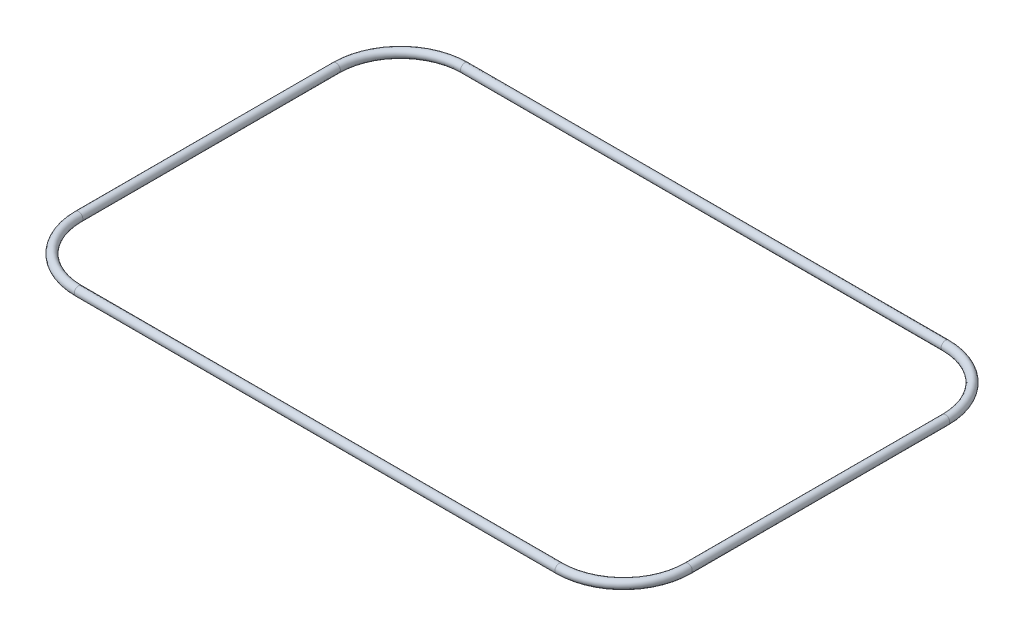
ISO-10303-21;
HEADER;
FILE_DESCRIPTION(('STEP AP214'),'2;1');
FILE_NAME('part.step','',(''),(''),'','','');
FILE_SCHEMA(('AUTOMOTIVE_DESIGN { 1 0 10303 214 1 1 1 1 }'));
ENDSEC;
DATA;
#1=APPLICATION_CONTEXT('core data for automotive mechanical design processes');
#2=APPLICATION_PROTOCOL_DEFINITION('international standard','automotive_design',2000,#1);
#3=PRODUCT_CONTEXT('',#1,'mechanical');
#4=PRODUCT('Part','Part','',(#3));
#5=PRODUCT_RELATED_PRODUCT_CATEGORY('part','',(#4));
#6=PRODUCT_DEFINITION_FORMATION('','',#4);
#7=PRODUCT_DEFINITION_CONTEXT('part definition',#1,'design');
#8=PRODUCT_DEFINITION('design','',#6,#7);
#9=PRODUCT_DEFINITION_SHAPE('','',#8);
#10=(LENGTH_UNIT() NAMED_UNIT(*) SI_UNIT(.MILLI.,.METRE.));
#11=(NAMED_UNIT(*) PLANE_ANGLE_UNIT() SI_UNIT($,.RADIAN.));
#12=(NAMED_UNIT(*) SI_UNIT($,.STERADIAN.) SOLID_ANGLE_UNIT());
#13=UNCERTAINTY_MEASURE_WITH_UNIT(LENGTH_MEASURE(1.E-05),#10,'distance_accuracy_value','');
#14=(GEOMETRIC_REPRESENTATION_CONTEXT(3) GLOBAL_UNCERTAINTY_ASSIGNED_CONTEXT((#13)) GLOBAL_UNIT_ASSIGNED_CONTEXT((#10,
#11,#12)) REPRESENTATION_CONTEXT('',''));
#15=CARTESIAN_POINT('',(0.,0.,0.));
#16=DIRECTION('',(0.,0.,1.));
#17=DIRECTION('',(1.,0.,0.));
#18=AXIS2_PLACEMENT_3D('',#15,#16,#17);
#19=CARTESIAN_POINT('',(56.355,0.,23.81375));
#20=DIRECTION('',(0.,0.,-1.));
#21=DIRECTION('',(-1.,0.,0.));
#22=AXIS2_PLACEMENT_3D('',#19,#20,#21);
#23=CYLINDRICAL_SURFACE('',#22,0.793750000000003);
#24=CARTESIAN_POINT('',(56.355,0.,-23.81375));
#25=DIRECTION('',(0.,0.,-1.));
#26=DIRECTION('',(-1.,0.,0.));
#27=AXIS2_PLACEMENT_3D('',#24,#25,#26);
#28=CIRCLE('',#27,0.793750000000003);
#29=CARTESIAN_POINT('',(57.14875,0.,-23.81375));
#30=VERTEX_POINT('',#29);
#31=EDGE_CURVE('E81',#30,#30,#28,.T.);
#32=ORIENTED_EDGE('',*,*,#31,.F.);
#33=EDGE_LOOP('',(#32));
#34=FACE_BOUND('',#33,.T.);
#35=CARTESIAN_POINT('',(56.355,0.,23.81375));
#36=DIRECTION('',(0.,0.,-1.));
#37=DIRECTION('',(-1.,0.,0.));
#38=AXIS2_PLACEMENT_3D('',#35,#36,#37);
#39=CIRCLE('',#38,0.793750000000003);
#40=CARTESIAN_POINT('',(57.14875,0.,23.81375));
#41=VERTEX_POINT('',#40);
#42=EDGE_CURVE('E11',#41,#41,#39,.T.);
#43=ORIENTED_EDGE('',*,*,#42,.T.);
#44=EDGE_LOOP('',(#43));
#45=FACE_BOUND('',#44,.T.);
#46=ADVANCED_FACE('F44',(#34,#45),#23,.T.);
#47=CARTESIAN_POINT('',(44.44875,0.,23.81375));
#48=DIRECTION('',(0.,1.,0.));
#49=DIRECTION('',(0.,0.,1.));
#50=AXIS2_PLACEMENT_3D('',#47,#48,#49);
#51=TOROIDAL_SURFACE('',#50,11.90625,0.793750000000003);
#52=CARTESIAN_POINT('',(44.44875,0.,35.72));
#53=DIRECTION('',(1.,0.,0.));
#54=DIRECTION('',(0.,0.,-1.));
#55=AXIS2_PLACEMENT_3D('',#52,#53,#54);
#56=CIRCLE('',#55,0.793750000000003);
#57=CARTESIAN_POINT('',(44.44875,0.,36.51375));
#58=VERTEX_POINT('',#57);
#59=EDGE_CURVE('E51',#58,#58,#56,.T.);
#60=CARTESIAN_POINT('',(44.44875,0.,23.81375));
#61=DIRECTION('',(0.,1.,0.));
#62=DIRECTION('',(0.,0.,1.));
#63=AXIS2_PLACEMENT_3D('',#60,#61,#62);
#64=CIRCLE('',#63,12.7);
#65=EDGE_CURVE('',#58,#41,#64,.T.);
#66=ORIENTED_EDGE('',*,*,#59,.T.);
#67=ORIENTED_EDGE('',*,*,#42,.F.);
#68=ORIENTED_EDGE('',*,*,#65,.T.);
#69=ORIENTED_EDGE('',*,*,#65,.F.);
#70=EDGE_LOOP('',(#66,#68,#67,#69));
#71=FACE_BOUND('',#70,.T.);
#72=ADVANCED_FACE('F90',(#71),#51,.T.);
#73=CARTESIAN_POINT('',(-44.44875,0.,35.72));
#74=DIRECTION('',(1.,0.,0.));
#75=DIRECTION('',(0.,0.,-1.));
#76=AXIS2_PLACEMENT_3D('',#73,#74,#75);
#77=CYLINDRICAL_SURFACE('',#76,0.793750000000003);
#78=ORIENTED_EDGE('',*,*,#59,.F.);
#79=EDGE_LOOP('',(#78));
#80=FACE_BOUND('',#79,.T.);
#81=CARTESIAN_POINT('',(-44.44875,0.,35.72));
#82=DIRECTION('',(1.,0.,0.));
#83=DIRECTION('',(0.,0.,-1.));
#84=AXIS2_PLACEMENT_3D('',#81,#82,#83);
#85=CIRCLE('',#84,0.793750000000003);
#86=CARTESIAN_POINT('',(-44.44875,0.,36.51375));
#87=VERTEX_POINT('',#86);
#88=EDGE_CURVE('E57',#87,#87,#85,.T.);
#89=ORIENTED_EDGE('',*,*,#88,.T.);
#90=EDGE_LOOP('',(#89));
#91=FACE_BOUND('',#90,.T.);
#92=ADVANCED_FACE('F94',(#80,#91),#77,.T.);
#93=CARTESIAN_POINT('',(-44.44875,0.,23.81375));
#94=DIRECTION('',(0.,1.,0.));
#95=DIRECTION('',(0.,0.,1.));
#96=AXIS2_PLACEMENT_3D('',#93,#94,#95);
#97=TOROIDAL_SURFACE('',#96,11.90625,0.793750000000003);
#98=CARTESIAN_POINT('',(-56.355,0.,23.81375));
#99=DIRECTION('',(0.,0.,1.));
#100=DIRECTION('',(1.,0.,0.));
#101=AXIS2_PLACEMENT_3D('',#98,#99,#100);
#102=CIRCLE('',#101,0.793750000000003);
#103=CARTESIAN_POINT('',(-57.14875,0.,23.81375));
#104=VERTEX_POINT('',#103);
#105=EDGE_CURVE('E63',#104,#104,#102,.T.);
#106=CARTESIAN_POINT('',(-44.44875,0.,23.81375));
#107=DIRECTION('',(0.,1.,0.));
#108=DIRECTION('',(0.,0.,1.));
#109=AXIS2_PLACEMENT_3D('',#106,#107,#108);
#110=CIRCLE('',#109,12.7);
#111=EDGE_CURVE('',#104,#87,#110,.T.);
#112=ORIENTED_EDGE('',*,*,#105,.T.);
#113=ORIENTED_EDGE('',*,*,#88,.F.);
#114=ORIENTED_EDGE('',*,*,#111,.T.);
#115=ORIENTED_EDGE('',*,*,#111,.F.);
#116=EDGE_LOOP('',(#112,#114,#113,#115));
#117=FACE_BOUND('',#116,.T.);
#118=ADVANCED_FACE('F99',(#117),#97,.T.);
#119=CARTESIAN_POINT('',(-56.355,0.,-23.81375));
#120=DIRECTION('',(0.,0.,1.));
#121=DIRECTION('',(1.,0.,0.));
#122=AXIS2_PLACEMENT_3D('',#119,#120,#121);
#123=CYLINDRICAL_SURFACE('',#122,0.793750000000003);
#124=ORIENTED_EDGE('',*,*,#105,.F.);
#125=EDGE_LOOP('',(#124));
#126=FACE_BOUND('',#125,.T.);
#127=CARTESIAN_POINT('',(-56.355,0.,-23.81375));
#128=DIRECTION('',(0.,0.,1.));
#129=DIRECTION('',(1.,0.,0.));
#130=AXIS2_PLACEMENT_3D('',#127,#128,#129);
#131=CIRCLE('',#130,0.793750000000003);
#132=CARTESIAN_POINT('',(-57.14875,0.,-23.81375));
#133=VERTEX_POINT('',#132);
#134=EDGE_CURVE('E69',#133,#133,#131,.T.);
#135=ORIENTED_EDGE('',*,*,#134,.T.);
#136=EDGE_LOOP('',(#135));
#137=FACE_BOUND('',#136,.T.);
#138=ADVANCED_FACE('F105',(#126,#137),#123,.T.);
#139=CARTESIAN_POINT('',(-44.44875,0.,-23.81375));
#140=DIRECTION('',(0.,1.,0.));
#141=DIRECTION('',(0.,0.,1.));
#142=AXIS2_PLACEMENT_3D('',#139,#140,#141);
#143=TOROIDAL_SURFACE('',#142,11.90625,0.793750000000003);
#144=CARTESIAN_POINT('',(-44.44875,0.,-35.72));
#145=DIRECTION('',(-1.,0.,0.));
#146=DIRECTION('',(0.,0.,1.));
#147=AXIS2_PLACEMENT_3D('',#144,#145,#146);
#148=CIRCLE('',#147,0.793750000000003);
#149=CARTESIAN_POINT('',(-44.44875,0.,-36.51375));
#150=VERTEX_POINT('',#149);
#151=EDGE_CURVE('E73',#150,#150,#148,.T.);
#152=CARTESIAN_POINT('',(-44.44875,0.,-23.81375));
#153=DIRECTION('',(0.,1.,0.));
#154=DIRECTION('',(0.,0.,1.));
#155=AXIS2_PLACEMENT_3D('',#152,#153,#154);
#156=CIRCLE('',#155,12.7);
#157=EDGE_CURVE('',#150,#133,#156,.T.);
#158=ORIENTED_EDGE('',*,*,#151,.T.);
#159=ORIENTED_EDGE('',*,*,#134,.F.);
#160=ORIENTED_EDGE('',*,*,#157,.T.);
#161=ORIENTED_EDGE('',*,*,#157,.F.);
#162=EDGE_LOOP('',(#158,#160,#159,#161));
#163=FACE_BOUND('',#162,.T.);
#164=ADVANCED_FACE('F109',(#163),#143,.T.);
#165=CARTESIAN_POINT('',(44.44875,0.,-35.72));
#166=DIRECTION('',(-1.,0.,0.));
#167=DIRECTION('',(0.,0.,1.));
#168=AXIS2_PLACEMENT_3D('',#165,#166,#167);
#169=CYLINDRICAL_SURFACE('',#168,0.793750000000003);
#170=ORIENTED_EDGE('',*,*,#151,.F.);
#171=EDGE_LOOP('',(#170));
#172=FACE_BOUND('',#171,.T.);
#173=CARTESIAN_POINT('',(44.44875,0.,-35.72));
#174=DIRECTION('',(-1.,0.,0.));
#175=DIRECTION('',(0.,0.,1.));
#176=AXIS2_PLACEMENT_3D('',#173,#174,#175);
#177=CIRCLE('',#176,0.793750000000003);
#178=CARTESIAN_POINT('',(44.44875,0.,-36.51375));
#179=VERTEX_POINT('',#178);
#180=EDGE_CURVE('E77',#179,#179,#177,.T.);
#181=ORIENTED_EDGE('',*,*,#180,.T.);
#182=EDGE_LOOP('',(#181));
#183=FACE_BOUND('',#182,.T.);
#184=ADVANCED_FACE('F113',(#172,#183),#169,.T.);
#185=CARTESIAN_POINT('',(44.44875,0.,-23.81375));
#186=DIRECTION('',(0.,1.,0.));
#187=DIRECTION('',(0.,0.,1.));
#188=AXIS2_PLACEMENT_3D('',#185,#186,#187);
#189=TOROIDAL_SURFACE('',#188,11.90625,0.793750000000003);
#190=CARTESIAN_POINT('',(44.44875,0.,-23.81375));
#191=DIRECTION('',(0.,1.,0.));
#192=DIRECTION('',(0.,0.,1.));
#193=AXIS2_PLACEMENT_3D('',#190,#191,#192);
#194=CIRCLE('',#193,12.7);
#195=EDGE_CURVE('',#30,#179,#194,.T.);
#196=ORIENTED_EDGE('',*,*,#31,.T.);
#197=ORIENTED_EDGE('',*,*,#180,.F.);
#198=ORIENTED_EDGE('',*,*,#195,.T.);
#199=ORIENTED_EDGE('',*,*,#195,.F.);
#200=EDGE_LOOP('',(#196,#198,#197,#199));
#201=FACE_BOUND('',#200,.T.);
#202=ADVANCED_FACE('F87',(#201),#189,.T.);
#203=CLOSED_SHELL('',(#46,#72,#92,#118,#138,#164,#184,#202));
#204=MANIFOLD_SOLID_BREP('B2',#203);
#205=ADVANCED_BREP_SHAPE_REPRESENTATION('',(#18,#204),#14);
#206=SHAPE_DEFINITION_REPRESENTATION(#9,#205);
ENDSEC;
END-ISO-10303-21;
